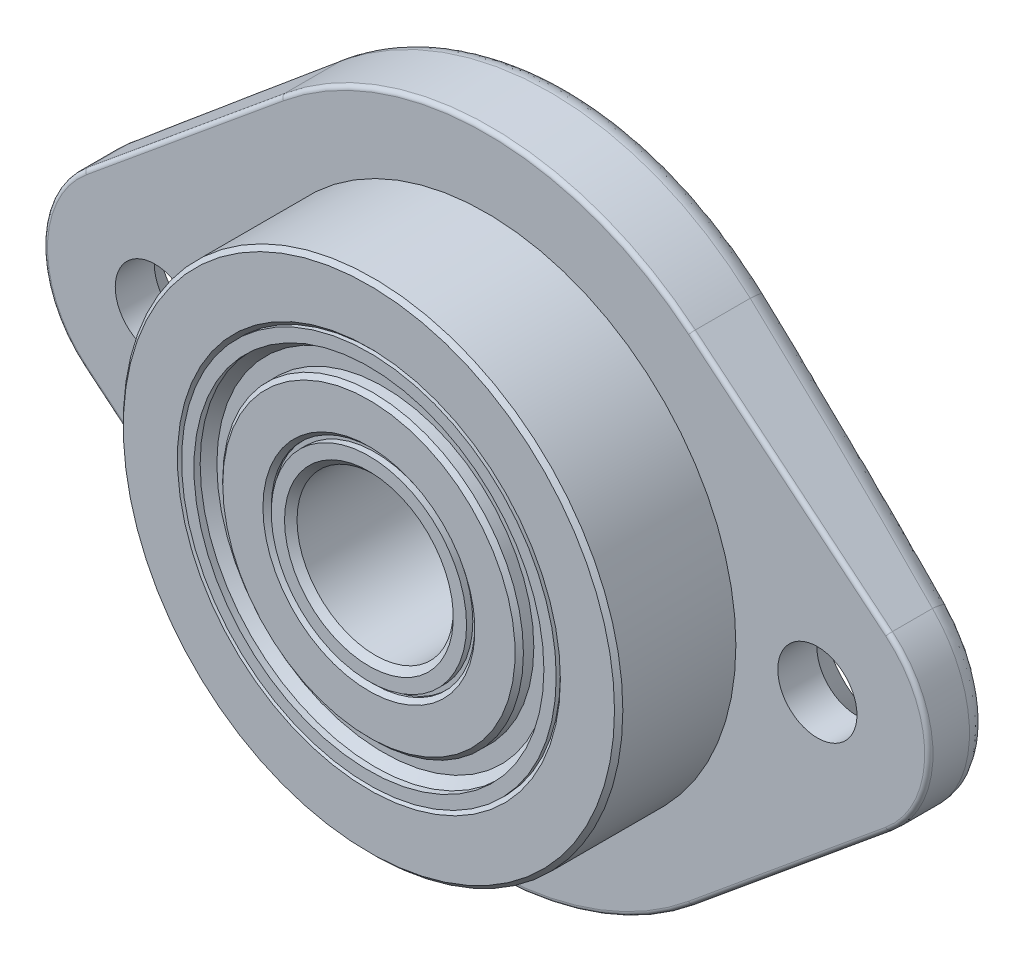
from build123d import *

# Parameters (mm, degrees)
CHAMFER2_SIZE           = 0.381
CHAMFER3_SIZE           = 0.254
CHAMFER4_SIZE           = 0.508
EXTRUDE1_START          = -6.151562
SKETCH2_R               = 2.413
EXTRUDE1_DEPTH          = 5.159375
SKETCH9_R               = 15.225117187
SKETCH9_R_2             = 11.418837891
BOSS_EXTRUDE2_DEPTH     = 7.14375
CHAMFER5_SIZE           = 0.254
CUT_EXTRUDE1_DEPTH      = 34.942674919
CUT_EXTRUDE1_DEPTH_BACK = 34.942674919
FILLET2_R               = 1.27
FILLET3_R               = 0.254


with BuildPart() as part:
    # Sketch3 → Revolve1 (revolve)
    with BuildSketch(Plane(origin=(0, 0, 0), x_dir=(0, 0, -1), z_dir=(1, 0, 0)), mode=Mode.PRIVATE) as revolve1_sk:
        Polygon((-6.1515625, 5.953125), (-5.7705625, 5.953125), (-5.7705625, 6.207125), (-6.1515625, 6.207125), (-6.1515625, 9.165497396), (-5.2625625, 9.165497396), (-5.2625625, 10.667724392), (-6.1515625, 10.667724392), (-6.1515625, 11.418837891), (0.9921875, 11.418837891), (0.9921875, 4.7625), (-6.1515625, 4.7625), align=None)
    revolve(revolve1_sk.sketch.rotate(Axis((0, 0, 6.1515625), (0, 0, -1)), 90), axis=Axis((0, 0, 6.1515625), (0, 0, -1)))

    # Chamfer2
    chamfer2_edges = [part.edges().sort_by_distance(p)[0] for p in [
        (-4.7625, 0, 6.1515625),
    ]]
    chamfer(chamfer2_edges, length=CHAMFER2_SIZE)

    # Chamfer3
    chamfer3_edges = [part.edges().sort_by_distance(p)[0] for p in [
        (-6.207125, 0, 6.1515625),
        (-9.165497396, 0, 6.1515625),
    ]]
    chamfer(chamfer3_edges, length=CHAMFER3_SIZE)

    # Chamfer4
    chamfer4_edges = [part.edges().sort_by_distance(p)[0] for p in [
        (-10.667724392, 0, 5.2625625),
    ]]
    chamfer(chamfer4_edges, length=CHAMFER4_SIZE)


with BuildPart() as body_2:
    # Sketch2 → Extrude1 (new body)
    with BuildSketch(Plane.XY.offset(EXTRUDE1_START)):
        with BuildLine():
            Line((24.517015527, 5.241003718), (12.502264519, 15.15360304))
            ThreePointArc((12.502264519, 15.15360304), (0, 19.6453125), (-12.502264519, 15.15360304))
            Line((-12.502264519, 15.15360304), (-24.517015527, 5.241003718))
            ThreePointArc((-24.517015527, 5.241003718), (-26.9875, 0), (-24.517015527, -5.241003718))
            Line((-24.517015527, -5.241003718), (-12.502264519, -15.15360304))
            ThreePointArc((-12.502264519, -15.15360304), (0, -19.6453125), (12.502264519, -15.15360304))
            Line((12.502264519, -15.15360304), (24.517015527, -5.241003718))
            ThreePointArc((24.517015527, -5.241003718), (26.9875, 0), (24.517015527, 5.241003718))
        make_face()
        with Locations((20.193, 0)):
            Circle(SKETCH2_R, mode=Mode.SUBTRACT)
        with Locations((-20.193, 0)):
            Circle(SKETCH2_R, mode=Mode.SUBTRACT)
    extrude(amount=EXTRUDE1_DEPTH)

    # Sketch9 → Boss-Extrude2 (add)
    with BuildSketch(Plane.XY.offset(-0.9921875)):
        Circle(SKETCH9_R)
        Circle(SKETCH9_R_2, mode=Mode.SUBTRACT)
    extrude(amount=BOSS_EXTRUDE2_DEPTH)

    # Chamfer5
    chamfer5_edges = [body_2.edges().sort_by_distance(p)[0] for p in [
        (-15.225117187, 0, 6.1515625),
        (-11.418837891, 0, 6.1515625),
    ]]
    chamfer(chamfer5_edges, length=CHAMFER5_SIZE)

    # Cut-Extrude2 cone 1 section (on through the dimple's axis) → Cut-Extrude2 (revolve, cut)
    with BuildSketch(Plane(origin=(20.193, 0, -6.1515625), x_dir=(0, 1, 0), z_dir=(1, 0, 0))):
        Polygon((0, 0), (4.826, 0), (0, 5.551677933), align=None)
    revolve(axis=Axis((20.193, 0, -6.1515625), (0, 0, 1)), mode=Mode.SUBTRACT)

    # Cut-Extrude2 cone 2 section (on through the dimple's axis) → Cut-Extrude2 cone 2 (revolve, cut)
    with BuildSketch(Plane(origin=(-20.193, 0, -6.1515625), x_dir=(0, 1, 0), z_dir=(1, 0, 0))):
        Polygon((0, 0), (4.826, 0), (0, 5.551677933), align=None)
    revolve(axis=Axis((-20.193, 0, -6.1515625), (0, 0, 1)), mode=Mode.SUBTRACT)

    # Sketch5 → Cut-Extrude1 (cut, two sides: drawn at the far end of the back side and taken through both)
    with BuildSketch(Plane(origin=(0, 0, 0), x_dir=(1, 0, 0), z_dir=(0, 1, 0)).offset(-CUT_EXTRUDE1_DEPTH_BACK)):
        with BuildLine():
            Line((-26.9875, 4.60375), (-26.9875, 6.6595625))
            Line((-26.9875, 6.6595625), (26.9875, 6.6595625))
            Line((26.9875, 6.6595625), (26.9875, 4.60375))
            ThreePointArc((26.9875, 4.60375), (0, 6.1515625), (-26.9875, 4.60375))
        make_face()
    extrude(amount=CUT_EXTRUDE1_DEPTH + CUT_EXTRUDE1_DEPTH_BACK, mode=Mode.SUBTRACT)

    # Fillet2
    fillet2_edges = [body_2.edges().sort_by_distance(p)[0] for p in [
        (6.651147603, 18.485143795, -6.057839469),
        (-6.651147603, -18.485143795, -6.057839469),
        (18.513239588, -10.19433361, -5.424450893),
        (26.337764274, 2.899500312, -4.677611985),
        (18.513239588, 10.19433361, -5.424450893),
        (-18.513239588, 10.19433361, -5.424450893),
        (-26.9875, 0, -4.60375),
        (-18.513239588, -10.19433361, -5.424450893),
    ]]
    fillet(fillet2_edges, radius=FILLET2_R)

    # Fillet3
    fillet3_edges = [body_2.edges().sort_by_distance(p)[0] for p in [
        (0, 19.6453125, -0.992187),
        (-18.509640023, 10.197303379, -0.992187),
        (-26.9875, 0, -0.992187),
        (-18.509640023, -10.197303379, -0.992187),
        (0, -19.6453125, -0.992187),
        (18.509640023, -10.197303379, -0.992187),
        (26.9875, 0, -0.992187),
        (18.509640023, 10.197303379, -0.992187),
    ]]
    fillet(fillet3_edges, radius=FILLET3_R)


solid = Compound([part.part, body_2.part])
